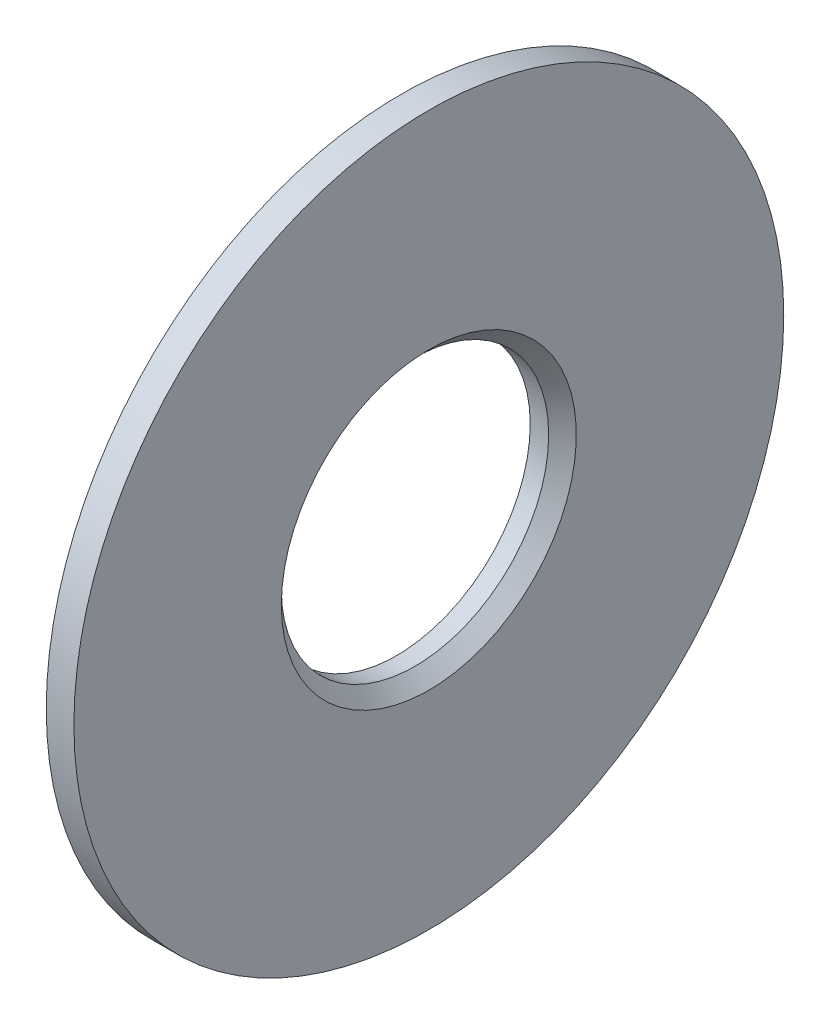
ISO-10303-21;
HEADER;
FILE_DESCRIPTION(('STEP AP214'),'2;1');
FILE_NAME('part.step','',(''),(''),'','','');
FILE_SCHEMA(('AUTOMOTIVE_DESIGN { 1 0 10303 214 1 1 1 1 }'));
ENDSEC;
DATA;
#1=APPLICATION_CONTEXT('core data for automotive mechanical design processes');
#2=APPLICATION_PROTOCOL_DEFINITION('international standard','automotive_design',2000,#1);
#3=PRODUCT_CONTEXT('',#1,'mechanical');
#4=PRODUCT('Part','Part','',(#3));
#5=PRODUCT_RELATED_PRODUCT_CATEGORY('part','',(#4));
#6=PRODUCT_DEFINITION_FORMATION('','',#4);
#7=PRODUCT_DEFINITION_CONTEXT('part definition',#1,'design');
#8=PRODUCT_DEFINITION('design','',#6,#7);
#9=PRODUCT_DEFINITION_SHAPE('','',#8);
#10=(LENGTH_UNIT() NAMED_UNIT(*) SI_UNIT(.MILLI.,.METRE.));
#11=(NAMED_UNIT(*) PLANE_ANGLE_UNIT() SI_UNIT($,.RADIAN.));
#12=(NAMED_UNIT(*) SI_UNIT($,.STERADIAN.) SOLID_ANGLE_UNIT());
#13=UNCERTAINTY_MEASURE_WITH_UNIT(LENGTH_MEASURE(1.E-05),#10,'distance_accuracy_value','');
#14=(GEOMETRIC_REPRESENTATION_CONTEXT(3) GLOBAL_UNCERTAINTY_ASSIGNED_CONTEXT((#13)) GLOBAL_UNIT_ASSIGNED_CONTEXT((#10,
#11,#12)) REPRESENTATION_CONTEXT('',''));
#15=CARTESIAN_POINT('',(0.,0.,0.));
#16=DIRECTION('',(0.,0.,1.));
#17=DIRECTION('',(1.,0.,0.));
#18=AXIS2_PLACEMENT_3D('',#15,#16,#17);
#19=CARTESIAN_POINT('',(0.,72.5,0.));
#20=DIRECTION('',(1.,0.,0.));
#21=DIRECTION('',(0.,0.,-1.));
#22=AXIS2_PLACEMENT_3D('',#19,#20,#21);
#23=PLANE('',#22);
#24=CARTESIAN_POINT('',(0.,0.,0.));
#25=DIRECTION('',(-1.,0.,0.));
#26=DIRECTION('',(0.,0.,1.));
#27=AXIS2_PLACEMENT_3D('',#24,#25,#26);
#28=CIRCLE('',#27,72.5);
#29=CARTESIAN_POINT('',(0.,0.,72.5));
#30=VERTEX_POINT('',#29);
#31=EDGE_CURVE('E10',#30,#30,#28,.T.);
#32=ORIENTED_EDGE('',*,*,#31,.F.);
#33=EDGE_LOOP('',(#32));
#34=FACE_BOUND('',#33,.T.);
#35=CARTESIAN_POINT('',(0.,0.,0.));
#36=DIRECTION('',(-1.,0.,0.));
#37=DIRECTION('',(0.,0.,1.));
#38=AXIS2_PLACEMENT_3D('',#35,#36,#37);
#39=CIRCLE('',#38,85.);
#40=CARTESIAN_POINT('',(0.,0.,85.));
#41=VERTEX_POINT('',#40);
#42=EDGE_CURVE('E53',#41,#41,#39,.T.);
#43=ORIENTED_EDGE('',*,*,#42,.T.);
#44=EDGE_LOOP('',(#43));
#45=FACE_BOUND('',#44,.T.);
#46=ADVANCED_FACE('F28',(#34,#45),#23,.F.);
#47=CARTESIAN_POINT('',(0.,0.,0.));
#48=DIRECTION('',(-1.,0.,0.));
#49=DIRECTION('',(0.,0.,1.));
#50=AXIS2_PLACEMENT_3D('',#47,#48,#49);
#51=CYLINDRICAL_SURFACE('',#50,72.5);
#52=CARTESIAN_POINT('',(10.,0.,0.));
#53=DIRECTION('',(-1.,0.,0.));
#54=DIRECTION('',(0.,0.,1.));
#55=AXIS2_PLACEMENT_3D('',#52,#53,#54);
#56=CIRCLE('',#55,72.5);
#57=CARTESIAN_POINT('',(10.,0.,72.5));
#58=VERTEX_POINT('',#57);
#59=EDGE_CURVE('E34',#58,#58,#56,.T.);
#60=ORIENTED_EDGE('',*,*,#59,.F.);
#61=EDGE_LOOP('',(#60));
#62=FACE_BOUND('',#61,.T.);
#63=ORIENTED_EDGE('',*,*,#31,.T.);
#64=EDGE_LOOP('',(#63));
#65=FACE_BOUND('',#64,.T.);
#66=ADVANCED_FACE('F84',(#62,#65),#51,.F.);
#67=CARTESIAN_POINT('',(10.,0.,0.));
#68=DIRECTION('',(1.,0.,0.));
#69=DIRECTION('',(0.,0.,-1.));
#70=AXIS2_PLACEMENT_3D('',#67,#68,#69);
#71=CONICAL_SURFACE('',#70,72.5,0.78539816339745);
#72=CARTESIAN_POINT('',(17.5,0.,0.));
#73=DIRECTION('',(-1.,0.,0.));
#74=DIRECTION('',(0.,0.,1.));
#75=AXIS2_PLACEMENT_3D('',#72,#73,#74);
#76=CIRCLE('',#75,80.);
#77=CARTESIAN_POINT('',(17.5,0.,80.));
#78=VERTEX_POINT('',#77);
#79=EDGE_CURVE('E38',#78,#78,#76,.T.);
#80=ORIENTED_EDGE('',*,*,#79,.F.);
#81=EDGE_LOOP('',(#80));
#82=FACE_BOUND('',#81,.T.);
#83=ORIENTED_EDGE('',*,*,#59,.T.);
#84=EDGE_LOOP('',(#83));
#85=FACE_BOUND('',#84,.T.);
#86=ADVANCED_FACE('F79',(#82,#85),#71,.F.);
#87=CARTESIAN_POINT('',(17.5,80.,0.));
#88=DIRECTION('',(-1.,0.,0.));
#89=DIRECTION('',(0.,0.,1.));
#90=AXIS2_PLACEMENT_3D('',#87,#88,#89);
#91=PLANE('',#90);
#92=CARTESIAN_POINT('',(17.5,0.,0.));
#93=DIRECTION('',(-1.,0.,0.));
#94=DIRECTION('',(0.,0.,1.));
#95=AXIS2_PLACEMENT_3D('',#92,#93,#94);
#96=CIRCLE('',#95,192.5);
#97=CARTESIAN_POINT('',(17.5,0.,192.5));
#98=VERTEX_POINT('',#97);
#99=EDGE_CURVE('E42',#98,#98,#96,.T.);
#100=ORIENTED_EDGE('',*,*,#99,.F.);
#101=EDGE_LOOP('',(#100));
#102=FACE_BOUND('',#101,.T.);
#103=ORIENTED_EDGE('',*,*,#79,.T.);
#104=EDGE_LOOP('',(#103));
#105=FACE_BOUND('',#104,.T.);
#106=ADVANCED_FACE('F73',(#102,#105),#91,.F.);
#107=CARTESIAN_POINT('',(0.,0.,0.));
#108=DIRECTION('',(-1.,0.,0.));
#109=DIRECTION('',(0.,0.,1.));
#110=AXIS2_PLACEMENT_3D('',#107,#108,#109);
#111=CYLINDRICAL_SURFACE('',#110,192.5);
#112=CARTESIAN_POINT('',(2.5,0.,0.));
#113=DIRECTION('',(-1.,0.,0.));
#114=DIRECTION('',(0.,0.,1.));
#115=AXIS2_PLACEMENT_3D('',#112,#113,#114);
#116=CIRCLE('',#115,192.5);
#117=CARTESIAN_POINT('',(2.5,0.,192.5));
#118=VERTEX_POINT('',#117);
#119=EDGE_CURVE('E47',#118,#118,#116,.T.);
#120=ORIENTED_EDGE('',*,*,#119,.F.);
#121=EDGE_LOOP('',(#120));
#122=FACE_BOUND('',#121,.T.);
#123=ORIENTED_EDGE('',*,*,#99,.T.);
#124=EDGE_LOOP('',(#123));
#125=FACE_BOUND('',#124,.T.);
#126=ADVANCED_FACE('F67',(#122,#125),#111,.T.);
#127=CARTESIAN_POINT('',(2.50000000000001,192.5,0.));
#128=DIRECTION('',(1.,0.,0.));
#129=DIRECTION('',(0.,0.,-1.));
#130=AXIS2_PLACEMENT_3D('',#127,#128,#129);
#131=PLANE('',#130);
#132=CARTESIAN_POINT('',(2.50000000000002,0.,0.));
#133=DIRECTION('',(-1.,0.,0.));
#134=DIRECTION('',(0.,0.,1.));
#135=AXIS2_PLACEMENT_3D('',#132,#133,#134);
#136=CIRCLE('',#135,87.5);
#137=CARTESIAN_POINT('',(2.50000000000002,0.,87.5));
#138=VERTEX_POINT('',#137);
#139=EDGE_CURVE('E50',#138,#138,#136,.T.);
#140=ORIENTED_EDGE('',*,*,#139,.F.);
#141=EDGE_LOOP('',(#140));
#142=FACE_BOUND('',#141,.T.);
#143=ORIENTED_EDGE('',*,*,#119,.T.);
#144=EDGE_LOOP('',(#143));
#145=FACE_BOUND('',#144,.T.);
#146=ADVANCED_FACE('F61',(#142,#145),#131,.F.);
#147=CARTESIAN_POINT('',(2.50000000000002,0.,0.));
#148=DIRECTION('',(1.,0.,0.));
#149=DIRECTION('',(0.,0.,-1.));
#150=AXIS2_PLACEMENT_3D('',#147,#148,#149);
#151=CONICAL_SURFACE('',#150,87.5,0.785398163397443);
#152=ORIENTED_EDGE('',*,*,#42,.F.);
#153=EDGE_LOOP('',(#152));
#154=FACE_BOUND('',#153,.T.);
#155=ORIENTED_EDGE('',*,*,#139,.T.);
#156=EDGE_LOOP('',(#155));
#157=FACE_BOUND('',#156,.T.);
#158=ADVANCED_FACE('F58',(#154,#157),#151,.T.);
#159=CLOSED_SHELL('',(#46,#66,#86,#106,#126,#146,#158));
#160=MANIFOLD_SOLID_BREP('B2',#159);
#161=ADVANCED_BREP_SHAPE_REPRESENTATION('',(#18,#160),#14);
#162=SHAPE_DEFINITION_REPRESENTATION(#9,#161);
ENDSEC;
END-ISO-10303-21;
